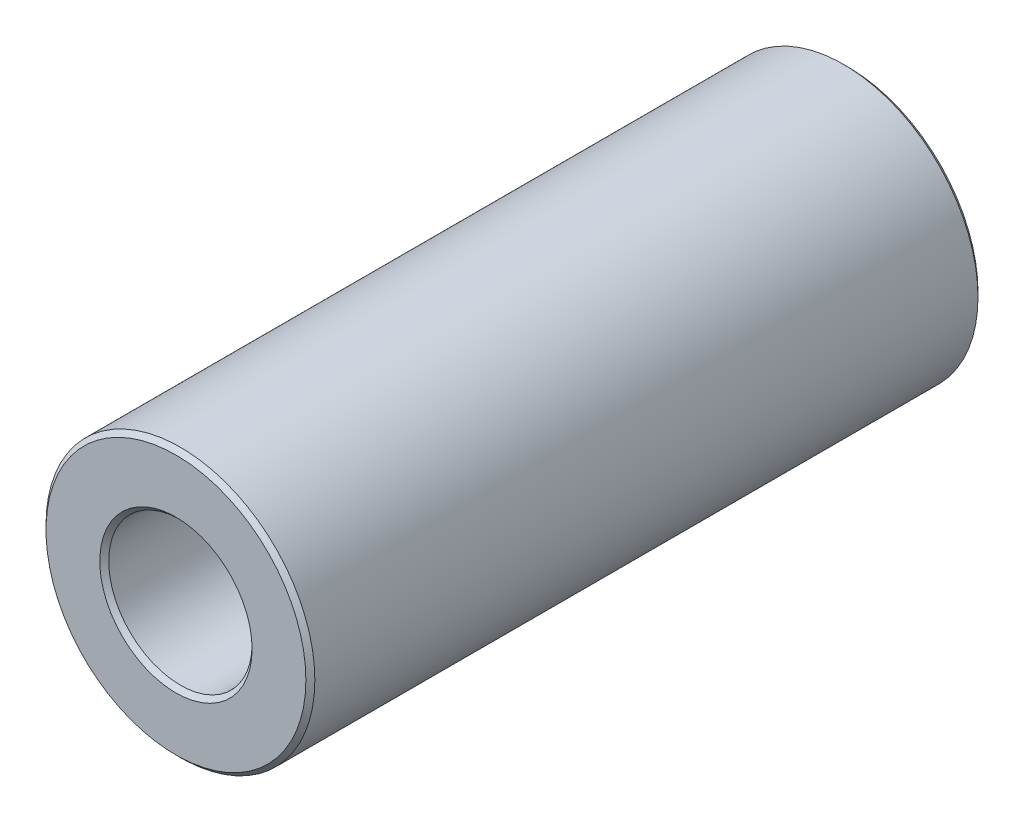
from build123d import *

# Parameters (mm, degrees)
SKETCH1_R           = 3
SKETCH1_R_2         = 1.6
BOSS_EXTRUDE2_DEPTH = 7.5
CHAMFER3_SIZE       = 0.1


with BuildPart() as part:
    # Sketch1 → Boss-Extrude2 (new, symmetric)
    with BuildSketch(Plane.XY):
        Circle(SKETCH1_R)
        Circle(SKETCH1_R_2, mode=Mode.SUBTRACT)
    extrude(amount=BOSS_EXTRUDE2_DEPTH, both=True)

    # Chamfer3
    chamfer3_edges = [part.edges().sort_by_distance(p)[0] for p in [
        (-3, 0, -7.5),
        (-3, 0, 7.5),
        (-1.6, 0, -7.5),
        (-1.6, 0, 7.5),
    ]]
    chamfer(chamfer3_edges, length=CHAMFER3_SIZE)


solid = part.part
